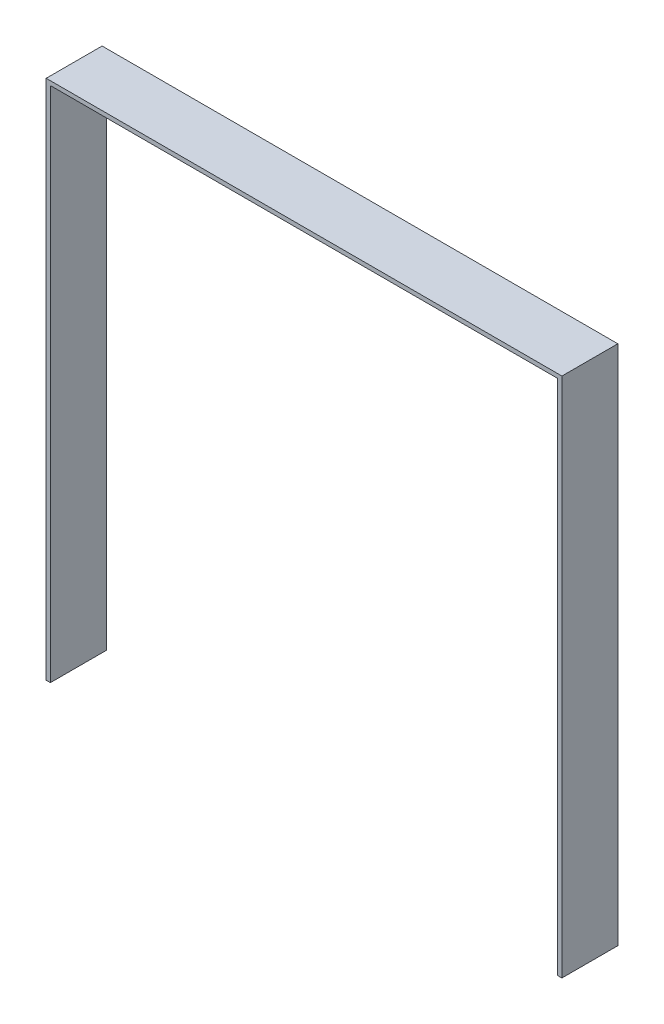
ISO-10303-21;
HEADER;
FILE_DESCRIPTION(('STEP AP214'),'2;1');
FILE_NAME('part.step','',(''),(''),'','','');
FILE_SCHEMA(('AUTOMOTIVE_DESIGN { 1 0 10303 214 1 1 1 1 }'));
ENDSEC;
DATA;
#1=APPLICATION_CONTEXT('core data for automotive mechanical design processes');
#2=APPLICATION_PROTOCOL_DEFINITION('international standard','automotive_design',2000,#1);
#3=PRODUCT_CONTEXT('',#1,'mechanical');
#4=PRODUCT('Part','Part','',(#3));
#5=PRODUCT_RELATED_PRODUCT_CATEGORY('part','',(#4));
#6=PRODUCT_DEFINITION_FORMATION('','',#4);
#7=PRODUCT_DEFINITION_CONTEXT('part definition',#1,'design');
#8=PRODUCT_DEFINITION('design','',#6,#7);
#9=PRODUCT_DEFINITION_SHAPE('','',#8);
#10=(LENGTH_UNIT() NAMED_UNIT(*) SI_UNIT(.MILLI.,.METRE.));
#11=(NAMED_UNIT(*) PLANE_ANGLE_UNIT() SI_UNIT($,.RADIAN.));
#12=(NAMED_UNIT(*) SI_UNIT($,.STERADIAN.) SOLID_ANGLE_UNIT());
#13=UNCERTAINTY_MEASURE_WITH_UNIT(LENGTH_MEASURE(1.E-05),#10,'distance_accuracy_value','');
#14=(GEOMETRIC_REPRESENTATION_CONTEXT(3) GLOBAL_UNCERTAINTY_ASSIGNED_CONTEXT((#13)) GLOBAL_UNIT_ASSIGNED_CONTEXT((#10,
#11,#12)) REPRESENTATION_CONTEXT('',''));
#15=CARTESIAN_POINT('',(0.,0.,0.));
#16=DIRECTION('',(0.,0.,1.));
#17=DIRECTION('',(1.,0.,0.));
#18=AXIS2_PLACEMENT_3D('',#15,#16,#17);
#19=CARTESIAN_POINT('',(-184.5,-186.5,20.));
#20=DIRECTION('',(0.,1.,0.));
#21=DIRECTION('',(0.,0.,1.));
#22=AXIS2_PLACEMENT_3D('',#19,#20,#21);
#23=PLANE('',#22);
#24=DIRECTION('',(1.,0.,0.));
#25=VECTOR('',#24,1.);
#26=CARTESIAN_POINT('',(-184.5,-186.5,-20.));
#27=LINE('',#26,#25);
#28=CARTESIAN_POINT('',(-184.5,-186.5,-20.));
#29=VERTEX_POINT('',#28);
#30=CARTESIAN_POINT('',(-181.5,-186.5,-20.));
#31=VERTEX_POINT('',#30);
#32=EDGE_CURVE('E140',#29,#31,#27,.T.);
#33=ORIENTED_EDGE('',*,*,#32,.T.);
#34=DIRECTION('',(0.,0.,-1.));
#35=VECTOR('',#34,1.);
#36=CARTESIAN_POINT('',(-181.5,-186.5,20.));
#37=LINE('',#36,#35);
#38=CARTESIAN_POINT('',(-181.5,-186.5,20.));
#39=VERTEX_POINT('',#38);
#40=EDGE_CURVE('E11',#39,#31,#37,.T.);
#41=ORIENTED_EDGE('',*,*,#40,.F.);
#42=DIRECTION('',(1.,0.,0.));
#43=VECTOR('',#42,1.);
#44=CARTESIAN_POINT('',(-184.5,-186.5,20.));
#45=LINE('',#44,#43);
#46=CARTESIAN_POINT('',(-184.5,-186.5,20.));
#47=VERTEX_POINT('',#46);
#48=EDGE_CURVE('E162',#47,#39,#45,.T.);
#49=ORIENTED_EDGE('',*,*,#48,.F.);
#50=DIRECTION('',(0.,0.,-1.));
#51=VECTOR('',#50,1.);
#52=CARTESIAN_POINT('',(-184.5,-186.5,20.));
#53=LINE('',#52,#51);
#54=EDGE_CURVE('E136',#47,#29,#53,.T.);
#55=ORIENTED_EDGE('',*,*,#54,.T.);
#56=EDGE_LOOP('',(#33,#41,#49,#55));
#57=FACE_BOUND('',#56,.T.);
#58=ADVANCED_FACE('F39',(#57),#23,.F.);
#59=CARTESIAN_POINT('',(-181.5,-186.5,20.));
#60=DIRECTION('',(-1.,0.,0.));
#61=DIRECTION('',(0.,-1.,0.));
#62=AXIS2_PLACEMENT_3D('',#59,#60,#61);
#63=PLANE('',#62);
#64=DIRECTION('',(0.,1.,0.));
#65=VECTOR('',#64,1.);
#66=CARTESIAN_POINT('',(-181.5,-186.5,-20.));
#67=LINE('',#66,#65);
#68=CARTESIAN_POINT('',(-181.5,183.5,-20.));
#69=VERTEX_POINT('',#68);
#70=EDGE_CURVE('E144',#31,#69,#67,.T.);
#71=ORIENTED_EDGE('',*,*,#70,.T.);
#72=DIRECTION('',(0.,0.,-1.));
#73=VECTOR('',#72,1.);
#74=CARTESIAN_POINT('',(-181.5,183.5,20.));
#75=LINE('',#74,#73);
#76=CARTESIAN_POINT('',(-181.5,183.5,20.));
#77=VERTEX_POINT('',#76);
#78=EDGE_CURVE('E48',#77,#69,#75,.T.);
#79=ORIENTED_EDGE('',*,*,#78,.F.);
#80=DIRECTION('',(0.,1.,0.));
#81=VECTOR('',#80,1.);
#82=CARTESIAN_POINT('',(-181.5,-186.5,20.));
#83=LINE('',#82,#81);
#84=EDGE_CURVE('E99',#39,#77,#83,.T.);
#85=ORIENTED_EDGE('',*,*,#84,.F.);
#86=ORIENTED_EDGE('',*,*,#40,.T.);
#87=EDGE_LOOP('',(#71,#79,#85,#86));
#88=FACE_BOUND('',#87,.T.);
#89=ADVANCED_FACE('F208',(#88),#63,.F.);
#90=CARTESIAN_POINT('',(-181.5,183.5,20.));
#91=DIRECTION('',(0.,1.,0.));
#92=DIRECTION('',(0.,0.,1.));
#93=AXIS2_PLACEMENT_3D('',#90,#91,#92);
#94=PLANE('',#93);
#95=DIRECTION('',(1.,0.,0.));
#96=VECTOR('',#95,1.);
#97=CARTESIAN_POINT('',(-181.5,183.5,-20.));
#98=LINE('',#97,#96);
#99=CARTESIAN_POINT('',(181.5,183.5,-20.));
#100=VERTEX_POINT('',#99);
#101=EDGE_CURVE('E147',#69,#100,#98,.T.);
#102=ORIENTED_EDGE('',*,*,#101,.T.);
#103=DIRECTION('',(0.,0.,-1.));
#104=VECTOR('',#103,1.);
#105=CARTESIAN_POINT('',(181.5,183.5,20.));
#106=LINE('',#105,#104);
#107=CARTESIAN_POINT('',(181.5,183.5,20.));
#108=VERTEX_POINT('',#107);
#109=EDGE_CURVE('E173',#108,#100,#106,.T.);
#110=ORIENTED_EDGE('',*,*,#109,.F.);
#111=DIRECTION('',(1.,0.,0.));
#112=VECTOR('',#111,1.);
#113=CARTESIAN_POINT('',(-181.5,183.5,20.));
#114=LINE('',#113,#112);
#115=EDGE_CURVE('E183',#77,#108,#114,.T.);
#116=ORIENTED_EDGE('',*,*,#115,.F.);
#117=ORIENTED_EDGE('',*,*,#78,.T.);
#118=EDGE_LOOP('',(#102,#110,#116,#117));
#119=FACE_BOUND('',#118,.T.);
#120=ADVANCED_FACE('F181',(#119),#94,.F.);
#121=CARTESIAN_POINT('',(181.5,-186.5,20.));
#122=DIRECTION('',(1.,0.,0.));
#123=DIRECTION('',(0.,1.,0.));
#124=AXIS2_PLACEMENT_3D('',#121,#122,#123);
#125=PLANE('',#124);
#126=DIRECTION('',(0.,-1.,0.));
#127=VECTOR('',#126,1.);
#128=CARTESIAN_POINT('',(181.5,-186.5,-20.));
#129=LINE('',#128,#127);
#130=CARTESIAN_POINT('',(181.5,-186.5,-20.));
#131=VERTEX_POINT('',#130);
#132=EDGE_CURVE('E150',#100,#131,#129,.T.);
#133=ORIENTED_EDGE('',*,*,#132,.T.);
#134=DIRECTION('',(0.,0.,-1.));
#135=VECTOR('',#134,1.);
#136=CARTESIAN_POINT('',(181.5,-186.5,20.));
#137=LINE('',#136,#135);
#138=CARTESIAN_POINT('',(181.5,-186.5,20.));
#139=VERTEX_POINT('',#138);
#140=EDGE_CURVE('E169',#139,#131,#137,.T.);
#141=ORIENTED_EDGE('',*,*,#140,.F.);
#142=DIRECTION('',(0.,-1.,0.));
#143=VECTOR('',#142,1.);
#144=CARTESIAN_POINT('',(181.5,-186.5,20.));
#145=LINE('',#144,#143);
#146=EDGE_CURVE('E196',#108,#139,#145,.T.);
#147=ORIENTED_EDGE('',*,*,#146,.F.);
#148=ORIENTED_EDGE('',*,*,#109,.T.);
#149=EDGE_LOOP('',(#133,#141,#147,#148));
#150=FACE_BOUND('',#149,.T.);
#151=ADVANCED_FACE('F191',(#150),#125,.F.);
#152=CARTESIAN_POINT('',(181.5,-186.5,20.));
#153=DIRECTION('',(0.,1.,0.));
#154=DIRECTION('',(0.,0.,1.));
#155=AXIS2_PLACEMENT_3D('',#152,#153,#154);
#156=PLANE('',#155);
#157=DIRECTION('',(1.,0.,0.));
#158=VECTOR('',#157,1.);
#159=CARTESIAN_POINT('',(181.5,-186.5,-20.));
#160=LINE('',#159,#158);
#161=CARTESIAN_POINT('',(184.5,-186.5,-20.));
#162=VERTEX_POINT('',#161);
#163=EDGE_CURVE('E153',#131,#162,#160,.T.);
#164=ORIENTED_EDGE('',*,*,#163,.T.);
#165=DIRECTION('',(0.,0.,-1.));
#166=VECTOR('',#165,1.);
#167=CARTESIAN_POINT('',(184.5,-186.5,20.));
#168=LINE('',#167,#166);
#169=CARTESIAN_POINT('',(184.5,-186.5,20.));
#170=VERTEX_POINT('',#169);
#171=EDGE_CURVE('E129',#170,#162,#168,.T.);
#172=ORIENTED_EDGE('',*,*,#171,.F.);
#173=DIRECTION('',(1.,0.,0.));
#174=VECTOR('',#173,1.);
#175=CARTESIAN_POINT('',(181.5,-186.5,20.));
#176=LINE('',#175,#174);
#177=EDGE_CURVE('E118',#139,#170,#176,.T.);
#178=ORIENTED_EDGE('',*,*,#177,.F.);
#179=ORIENTED_EDGE('',*,*,#140,.T.);
#180=EDGE_LOOP('',(#164,#172,#178,#179));
#181=FACE_BOUND('',#180,.T.);
#182=ADVANCED_FACE('F194',(#181),#156,.F.);
#183=CARTESIAN_POINT('',(184.5,-186.5,20.));
#184=DIRECTION('',(-1.,0.,0.));
#185=DIRECTION('',(0.,0.,1.));
#186=AXIS2_PLACEMENT_3D('',#183,#184,#185);
#187=PLANE('',#186);
#188=DIRECTION('',(0.,1.,0.));
#189=VECTOR('',#188,1.);
#190=CARTESIAN_POINT('',(184.5,-186.5,-20.));
#191=LINE('',#190,#189);
#192=CARTESIAN_POINT('',(184.5,186.5,-20.));
#193=VERTEX_POINT('',#192);
#194=EDGE_CURVE('E127',#162,#193,#191,.T.);
#195=ORIENTED_EDGE('',*,*,#194,.T.);
#196=DIRECTION('',(0.,0.,-1.));
#197=VECTOR('',#196,1.);
#198=CARTESIAN_POINT('',(184.5,186.5,20.));
#199=LINE('',#198,#197);
#200=CARTESIAN_POINT('',(184.5,186.5,20.));
#201=VERTEX_POINT('',#200);
#202=EDGE_CURVE('E124',#201,#193,#199,.T.);
#203=ORIENTED_EDGE('',*,*,#202,.F.);
#204=DIRECTION('',(0.,1.,0.));
#205=VECTOR('',#204,1.);
#206=CARTESIAN_POINT('',(184.5,-186.5,20.));
#207=LINE('',#206,#205);
#208=EDGE_CURVE('E112',#170,#201,#207,.T.);
#209=ORIENTED_EDGE('',*,*,#208,.F.);
#210=ORIENTED_EDGE('',*,*,#171,.T.);
#211=EDGE_LOOP('',(#195,#203,#209,#210));
#212=FACE_BOUND('',#211,.T.);
#213=ADVANCED_FACE('F125',(#212),#187,.F.);
#214=CARTESIAN_POINT('',(-184.5,186.5,20.));
#215=DIRECTION('',(0.,-1.,0.));
#216=DIRECTION('',(0.,0.,-1.));
#217=AXIS2_PLACEMENT_3D('',#214,#215,#216);
#218=PLANE('',#217);
#219=DIRECTION('',(-1.,0.,0.));
#220=VECTOR('',#219,1.);
#221=CARTESIAN_POINT('',(-184.5,186.5,-20.));
#222=LINE('',#221,#220);
#223=CARTESIAN_POINT('',(-184.5,186.5,-20.));
#224=VERTEX_POINT('',#223);
#225=EDGE_CURVE('E85',#193,#224,#222,.T.);
#226=ORIENTED_EDGE('',*,*,#225,.T.);
#227=DIRECTION('',(0.,0.,-1.));
#228=VECTOR('',#227,1.);
#229=CARTESIAN_POINT('',(-184.5,186.5,20.));
#230=LINE('',#229,#228);
#231=CARTESIAN_POINT('',(-184.5,186.5,20.));
#232=VERTEX_POINT('',#231);
#233=EDGE_CURVE('E130',#232,#224,#230,.T.);
#234=ORIENTED_EDGE('',*,*,#233,.F.);
#235=DIRECTION('',(-1.,0.,0.));
#236=VECTOR('',#235,1.);
#237=CARTESIAN_POINT('',(-184.5,186.5,20.));
#238=LINE('',#237,#236);
#239=EDGE_CURVE('E116',#201,#232,#238,.T.);
#240=ORIENTED_EDGE('',*,*,#239,.F.);
#241=ORIENTED_EDGE('',*,*,#202,.T.);
#242=EDGE_LOOP('',(#226,#234,#240,#241));
#243=FACE_BOUND('',#242,.T.);
#244=ADVANCED_FACE('F132',(#243),#218,.F.);
#245=CARTESIAN_POINT('',(-184.5,-186.5,20.));
#246=DIRECTION('',(1.,0.,0.));
#247=DIRECTION('',(0.,0.,-1.));
#248=AXIS2_PLACEMENT_3D('',#245,#246,#247);
#249=PLANE('',#248);
#250=DIRECTION('',(0.,-1.,0.));
#251=VECTOR('',#250,1.);
#252=CARTESIAN_POINT('',(-184.5,-186.5,-20.));
#253=LINE('',#252,#251);
#254=EDGE_CURVE('E91',#224,#29,#253,.T.);
#255=ORIENTED_EDGE('',*,*,#254,.T.);
#256=ORIENTED_EDGE('',*,*,#54,.F.);
#257=DIRECTION('',(0.,-1.,0.));
#258=VECTOR('',#257,1.);
#259=CARTESIAN_POINT('',(-184.5,-186.5,20.));
#260=LINE('',#259,#258);
#261=EDGE_CURVE('E56',#232,#47,#260,.T.);
#262=ORIENTED_EDGE('',*,*,#261,.F.);
#263=ORIENTED_EDGE('',*,*,#233,.T.);
#264=EDGE_LOOP('',(#255,#256,#262,#263));
#265=FACE_BOUND('',#264,.T.);
#266=ADVANCED_FACE('F224',(#265),#249,.F.);
#267=CARTESIAN_POINT('',(0.,0.,20.));
#268=DIRECTION('',(0.,0.,1.));
#269=DIRECTION('',(1.,0.,0.));
#270=AXIS2_PLACEMENT_3D('',#267,#268,#269);
#271=PLANE('',#270);
#272=ORIENTED_EDGE('',*,*,#48,.T.);
#273=ORIENTED_EDGE('',*,*,#84,.T.);
#274=ORIENTED_EDGE('',*,*,#115,.T.);
#275=ORIENTED_EDGE('',*,*,#146,.T.);
#276=ORIENTED_EDGE('',*,*,#177,.T.);
#277=ORIENTED_EDGE('',*,*,#208,.T.);
#278=ORIENTED_EDGE('',*,*,#239,.T.);
#279=ORIENTED_EDGE('',*,*,#261,.T.);
#280=EDGE_LOOP('',(#272,#273,#274,#275,#276,#277,#278,#279));
#281=FACE_BOUND('',#280,.T.);
#282=ADVANCED_FACE('F114',(#281),#271,.T.);
#283=CARTESIAN_POINT('',(0.,0.,-20.));
#284=DIRECTION('',(0.,0.,1.));
#285=DIRECTION('',(1.,0.,0.));
#286=AXIS2_PLACEMENT_3D('',#283,#284,#285);
#287=PLANE('',#286);
#288=ORIENTED_EDGE('',*,*,#32,.F.);
#289=ORIENTED_EDGE('',*,*,#254,.F.);
#290=ORIENTED_EDGE('',*,*,#225,.F.);
#291=ORIENTED_EDGE('',*,*,#194,.F.);
#292=ORIENTED_EDGE('',*,*,#163,.F.);
#293=ORIENTED_EDGE('',*,*,#132,.F.);
#294=ORIENTED_EDGE('',*,*,#101,.F.);
#295=ORIENTED_EDGE('',*,*,#70,.F.);
#296=EDGE_LOOP('',(#288,#289,#290,#291,#292,#293,#294,#295));
#297=FACE_BOUND('',#296,.T.);
#298=ADVANCED_FACE('F187',(#297),#287,.F.);
#299=CLOSED_SHELL('',(#58,#89,#120,#151,#182,#213,#244,#266,#282,#298));
#300=MANIFOLD_SOLID_BREP('B2',#299);
#301=ADVANCED_BREP_SHAPE_REPRESENTATION('',(#18,#300),#14);
#302=SHAPE_DEFINITION_REPRESENTATION(#9,#301);
ENDSEC;
END-ISO-10303-21;
